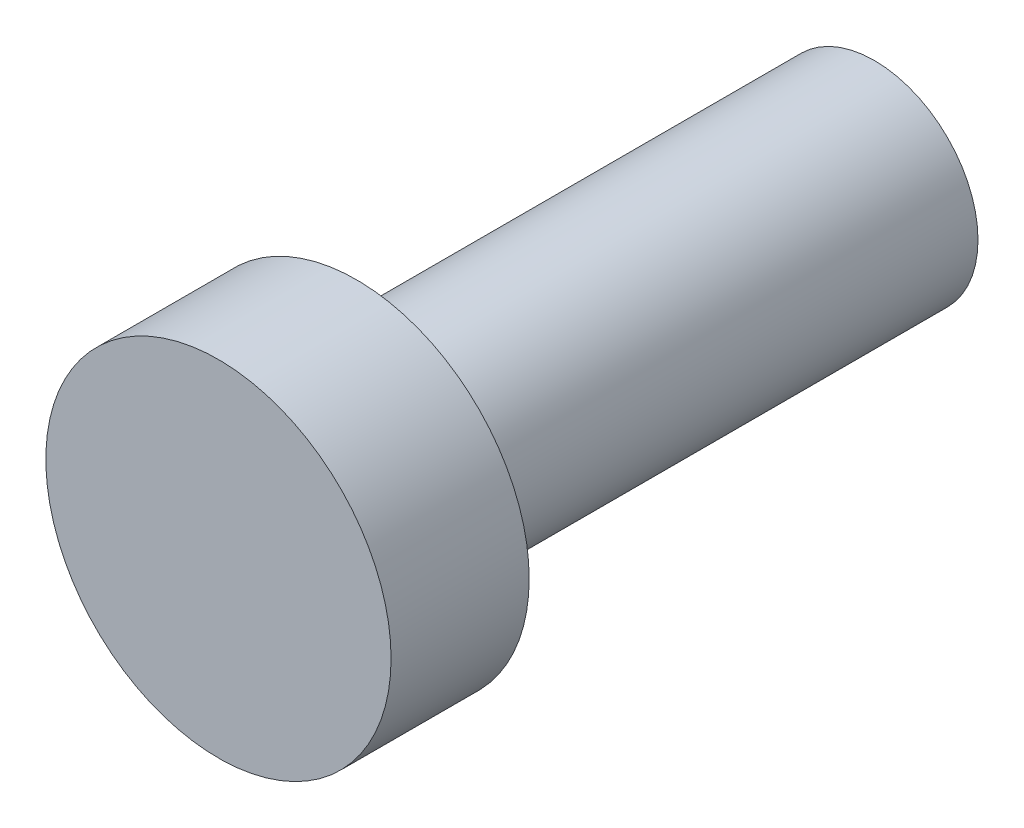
ISO-10303-21;
HEADER;
FILE_DESCRIPTION(('STEP AP214'),'2;1');
FILE_NAME('part.step','',(''),(''),'','','');
FILE_SCHEMA(('AUTOMOTIVE_DESIGN { 1 0 10303 214 1 1 1 1 }'));
ENDSEC;
DATA;
#1=APPLICATION_CONTEXT('core data for automotive mechanical design processes');
#2=APPLICATION_PROTOCOL_DEFINITION('international standard','automotive_design',2000,#1);
#3=PRODUCT_CONTEXT('',#1,'mechanical');
#4=PRODUCT('Part','Part','',(#3));
#5=PRODUCT_RELATED_PRODUCT_CATEGORY('part','',(#4));
#6=PRODUCT_DEFINITION_FORMATION('','',#4);
#7=PRODUCT_DEFINITION_CONTEXT('part definition',#1,'design');
#8=PRODUCT_DEFINITION('design','',#6,#7);
#9=PRODUCT_DEFINITION_SHAPE('','',#8);
#10=(LENGTH_UNIT() NAMED_UNIT(*) SI_UNIT(.MILLI.,.METRE.));
#11=(NAMED_UNIT(*) PLANE_ANGLE_UNIT() SI_UNIT($,.RADIAN.));
#12=(NAMED_UNIT(*) SI_UNIT($,.STERADIAN.) SOLID_ANGLE_UNIT());
#13=UNCERTAINTY_MEASURE_WITH_UNIT(LENGTH_MEASURE(1.E-05),#10,'distance_accuracy_value','');
#14=(GEOMETRIC_REPRESENTATION_CONTEXT(3) GLOBAL_UNCERTAINTY_ASSIGNED_CONTEXT((#13)) GLOBAL_UNIT_ASSIGNED_CONTEXT((#10,
#11,#12)) REPRESENTATION_CONTEXT('',''));
#15=CARTESIAN_POINT('',(0.,0.,0.));
#16=DIRECTION('',(0.,0.,1.));
#17=DIRECTION('',(1.,0.,0.));
#18=AXIS2_PLACEMENT_3D('',#15,#16,#17);
#19=CARTESIAN_POINT('',(0.,0.,4.));
#20=DIRECTION('',(0.,0.,-1.));
#21=DIRECTION('',(-1.,0.,0.));
#22=AXIS2_PLACEMENT_3D('',#19,#20,#21);
#23=CYLINDRICAL_SURFACE('',#22,5.);
#24=CARTESIAN_POINT('',(0.,0.,4.));
#25=DIRECTION('',(0.,0.,1.));
#26=DIRECTION('',(1.,0.,0.));
#27=AXIS2_PLACEMENT_3D('',#24,#25,#26);
#28=CIRCLE('',#27,5.);
#29=CARTESIAN_POINT('',(5.,0.,4.));
#30=VERTEX_POINT('',#29);
#31=EDGE_CURVE('E10',#30,#30,#28,.T.);
#32=ORIENTED_EDGE('',*,*,#31,.F.);
#33=EDGE_LOOP('',(#32));
#34=FACE_BOUND('',#33,.T.);
#35=CARTESIAN_POINT('',(0.,0.,0.));
#36=DIRECTION('',(0.,0.,1.));
#37=DIRECTION('',(1.,0.,0.));
#38=AXIS2_PLACEMENT_3D('',#35,#36,#37);
#39=CIRCLE('',#38,5.);
#40=CARTESIAN_POINT('',(5.,0.,0.));
#41=VERTEX_POINT('',#40);
#42=EDGE_CURVE('E32',#41,#41,#39,.T.);
#43=ORIENTED_EDGE('',*,*,#42,.T.);
#44=EDGE_LOOP('',(#43));
#45=FACE_BOUND('',#44,.T.);
#46=ADVANCED_FACE('F29',(#34,#45),#23,.T.);
#47=CARTESIAN_POINT('',(0.,0.,4.));
#48=DIRECTION('',(0.,0.,1.));
#49=DIRECTION('',(1.,0.,0.));
#50=AXIS2_PLACEMENT_3D('',#47,#48,#49);
#51=PLANE('',#50);
#52=ORIENTED_EDGE('',*,*,#31,.T.);
#53=EDGE_LOOP('',(#52));
#54=FACE_BOUND('',#53,.T.);
#55=ADVANCED_FACE('F59',(#54),#51,.T.);
#56=CARTESIAN_POINT('',(0.,0.,0.));
#57=DIRECTION('',(0.,0.,1.));
#58=DIRECTION('',(1.,0.,0.));
#59=AXIS2_PLACEMENT_3D('',#56,#57,#58);
#60=PLANE('',#59);
#61=CARTESIAN_POINT('',(0.,0.,0.));
#62=DIRECTION('',(0.,0.,1.));
#63=DIRECTION('',(1.,0.,0.));
#64=AXIS2_PLACEMENT_3D('',#61,#62,#63);
#65=CIRCLE('',#64,3.);
#66=CARTESIAN_POINT('',(3.,0.,0.));
#67=VERTEX_POINT('',#66);
#68=EDGE_CURVE('E41',#67,#67,#65,.T.);
#69=ORIENTED_EDGE('',*,*,#68,.T.);
#70=EDGE_LOOP('',(#69));
#71=FACE_BOUND('',#70,.T.);
#72=ORIENTED_EDGE('',*,*,#42,.F.);
#73=EDGE_LOOP('',(#72));
#74=FACE_BOUND('',#73,.T.);
#75=ADVANCED_FACE('F56',(#71,#74),#60,.F.);
#76=CARTESIAN_POINT('',(0.,0.,-15.));
#77=DIRECTION('',(0.,0.,1.));
#78=DIRECTION('',(1.,0.,0.));
#79=AXIS2_PLACEMENT_3D('',#76,#77,#78);
#80=CYLINDRICAL_SURFACE('',#79,3.);
#81=CARTESIAN_POINT('',(0.,0.,-15.));
#82=DIRECTION('',(0.,0.,1.));
#83=DIRECTION('',(1.,0.,0.));
#84=AXIS2_PLACEMENT_3D('',#81,#82,#83);
#85=CIRCLE('',#84,3.);
#86=CARTESIAN_POINT('',(3.,0.,-15.));
#87=VERTEX_POINT('',#86);
#88=EDGE_CURVE('E39',#87,#87,#85,.T.);
#89=ORIENTED_EDGE('',*,*,#88,.T.);
#90=EDGE_LOOP('',(#89));
#91=FACE_BOUND('',#90,.T.);
#92=ORIENTED_EDGE('',*,*,#68,.F.);
#93=EDGE_LOOP('',(#92));
#94=FACE_BOUND('',#93,.T.);
#95=ADVANCED_FACE('F47',(#91,#94),#80,.T.);
#96=CARTESIAN_POINT('',(0.,0.,-15.));
#97=DIRECTION('',(0.,0.,1.));
#98=DIRECTION('',(1.,0.,0.));
#99=AXIS2_PLACEMENT_3D('',#96,#97,#98);
#100=PLANE('',#99);
#101=ORIENTED_EDGE('',*,*,#88,.F.);
#102=EDGE_LOOP('',(#101));
#103=FACE_BOUND('',#102,.T.);
#104=ADVANCED_FACE('F50',(#103),#100,.F.);
#105=CLOSED_SHELL('',(#46,#55,#75,#95,#104));
#106=MANIFOLD_SOLID_BREP('B2',#105);
#107=ADVANCED_BREP_SHAPE_REPRESENTATION('',(#18,#106),#14);
#108=SHAPE_DEFINITION_REPRESENTATION(#9,#107);
ENDSEC;
END-ISO-10303-21;
